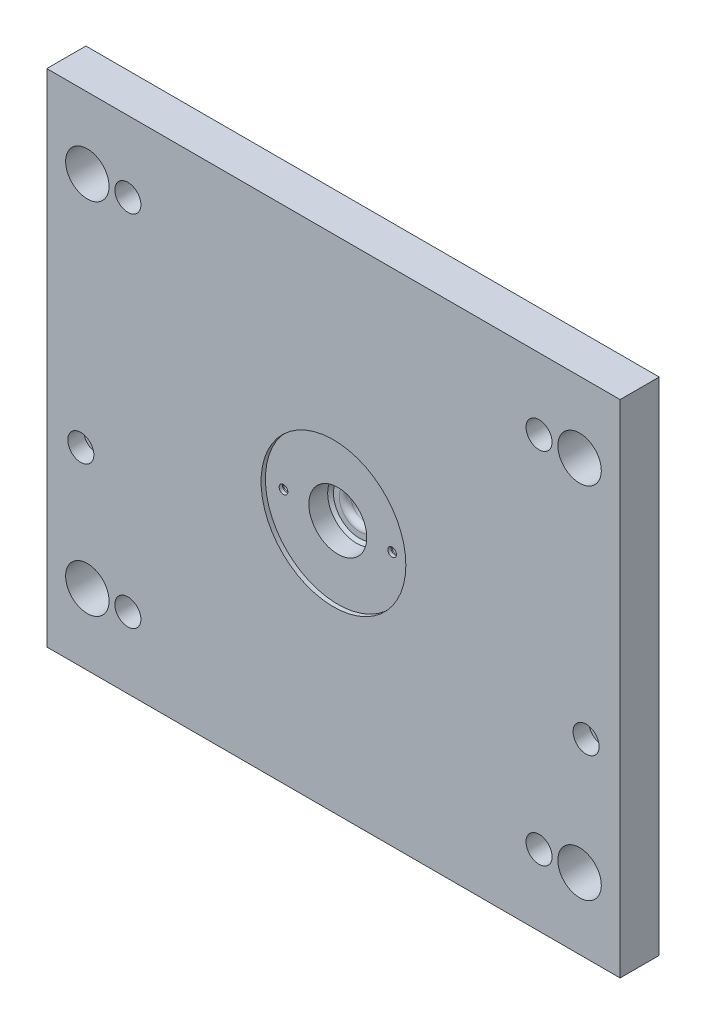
ISO-10303-21;
HEADER;
FILE_DESCRIPTION(('STEP AP214'),'2;1');
FILE_NAME('part.step','',(''),(''),'','','');
FILE_SCHEMA(('AUTOMOTIVE_DESIGN { 1 0 10303 214 1 1 1 1 }'));
ENDSEC;
DATA;
#1=APPLICATION_CONTEXT('core data for automotive mechanical design processes');
#2=APPLICATION_PROTOCOL_DEFINITION('international standard','automotive_design',2000,#1);
#3=PRODUCT_CONTEXT('',#1,'mechanical');
#4=PRODUCT('Part','Part','',(#3));
#5=PRODUCT_RELATED_PRODUCT_CATEGORY('part','',(#4));
#6=PRODUCT_DEFINITION_FORMATION('','',#4);
#7=PRODUCT_DEFINITION_CONTEXT('part definition',#1,'design');
#8=PRODUCT_DEFINITION('design','',#6,#7);
#9=PRODUCT_DEFINITION_SHAPE('','',#8);
#10=(LENGTH_UNIT() NAMED_UNIT(*) SI_UNIT(.MILLI.,.METRE.));
#11=(NAMED_UNIT(*) PLANE_ANGLE_UNIT() SI_UNIT($,.RADIAN.));
#12=(NAMED_UNIT(*) SI_UNIT($,.STERADIAN.) SOLID_ANGLE_UNIT());
#13=UNCERTAINTY_MEASURE_WITH_UNIT(LENGTH_MEASURE(1.E-05),#10,'distance_accuracy_value','');
#14=(GEOMETRIC_REPRESENTATION_CONTEXT(3) GLOBAL_UNCERTAINTY_ASSIGNED_CONTEXT((#13)) GLOBAL_UNIT_ASSIGNED_CONTEXT((#10,
#11,#12)) REPRESENTATION_CONTEXT('',''));
#15=CARTESIAN_POINT('',(0.,0.,0.));
#16=DIRECTION('',(0.,0.,1.));
#17=DIRECTION('',(1.,0.,0.));
#18=AXIS2_PLACEMENT_3D('',#15,#16,#17);
#19=CARTESIAN_POINT('',(0.,0.,60.));
#20=DIRECTION('',(0.,0.,-1.));
#21=DIRECTION('',(-1.,0.,0.));
#22=AXIS2_PLACEMENT_3D('',#19,#20,#21);
#23=PLANE('',#22);
#24=CARTESIAN_POINT('',(-37.5,1.71032187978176E-13,60.));
#25=DIRECTION('',(0.,0.,-1.));
#26=DIRECTION('',(-1.,0.,0.));
#27=AXIS2_PLACEMENT_3D('',#24,#25,#26);
#28=CIRCLE('',#27,3.);
#29=CARTESIAN_POINT('',(-40.5,1.71032187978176E-13,60.));
#30=VERTEX_POINT('',#29);
#31=EDGE_CURVE('E115',#30,#30,#28,.T.);
#32=ORIENTED_EDGE('',*,*,#31,.T.);
#33=EDGE_LOOP('',(#32));
#34=FACE_BOUND('',#33,.T.);
#35=CARTESIAN_POINT('',(37.5,1.7562446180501E-13,60.));
#36=DIRECTION('',(0.,0.,-1.));
#37=DIRECTION('',(-1.,0.,0.));
#38=AXIS2_PLACEMENT_3D('',#35,#36,#37);
#39=CIRCLE('',#38,3.);
#40=CARTESIAN_POINT('',(34.5,1.7562446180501E-13,60.));
#41=VERTEX_POINT('',#40);
#42=EDGE_CURVE('E186',#41,#41,#39,.T.);
#43=ORIENTED_EDGE('',*,*,#42,.T.);
#44=EDGE_LOOP('',(#43));
#45=FACE_BOUND('',#44,.T.);
#46=CARTESIAN_POINT('',(0.,0.,60.));
#47=DIRECTION('',(0.,0.,1.));
#48=DIRECTION('',(1.,0.,0.));
#49=AXIS2_PLACEMENT_3D('',#46,#47,#48);
#50=CIRCLE('',#49,50.);
#51=CARTESIAN_POINT('',(50.,0.,60.));
#52=VERTEX_POINT('',#51);
#53=EDGE_CURVE('E183',#52,#52,#50,.T.);
#54=ORIENTED_EDGE('',*,*,#53,.T.);
#55=EDGE_LOOP('',(#54));
#56=FACE_BOUND('',#55,.T.);
#57=CARTESIAN_POINT('',(0.,0.,60.));
#58=DIRECTION('',(0.,0.,-1.));
#59=DIRECTION('',(-1.,0.,0.));
#60=AXIS2_PLACEMENT_3D('',#57,#58,#59);
#61=CIRCLE('',#60,20.);
#62=CARTESIAN_POINT('',(-20.,0.,60.));
#63=VERTEX_POINT('',#62);
#64=EDGE_CURVE('E187',#63,#63,#61,.F.);
#65=ORIENTED_EDGE('',*,*,#64,.F.);
#66=EDGE_LOOP('',(#65));
#67=FACE_BOUND('',#66,.T.);
#68=ADVANCED_FACE('F16',(#34,#45,#56,#67),#23,.F.);
#69=CARTESIAN_POINT('',(198.,173.,63.));
#70=DIRECTION('',(1.,0.,0.));
#71=DIRECTION('',(0.,1.,0.));
#72=AXIS2_PLACEMENT_3D('',#69,#70,#71);
#73=PLANE('',#72);
#74=DIRECTION('',(0.,-1.,0.));
#75=VECTOR('',#74,1.);
#76=CARTESIAN_POINT('',(198.,173.,36.));
#77=LINE('',#76,#75);
#78=CARTESIAN_POINT('',(198.,173.,36.));
#79=VERTEX_POINT('',#78);
#80=CARTESIAN_POINT('',(198.,-173.,36.));
#81=VERTEX_POINT('',#80);
#82=EDGE_CURVE('E78',#79,#81,#77,.T.);
#83=ORIENTED_EDGE('',*,*,#82,.F.);
#84=DIRECTION('',(0.,0.,-1.));
#85=VECTOR('',#84,1.);
#86=CARTESIAN_POINT('',(198.,173.,63.));
#87=LINE('',#86,#85);
#88=CARTESIAN_POINT('',(198.,173.,63.));
#89=VERTEX_POINT('',#88);
#90=EDGE_CURVE('E74',#89,#79,#87,.T.);
#91=ORIENTED_EDGE('',*,*,#90,.F.);
#92=DIRECTION('',(0.,-1.,0.));
#93=VECTOR('',#92,1.);
#94=CARTESIAN_POINT('',(198.,173.,63.));
#95=LINE('',#94,#93);
#96=CARTESIAN_POINT('',(198.,-173.,63.));
#97=VERTEX_POINT('',#96);
#98=EDGE_CURVE('E112',#89,#97,#95,.T.);
#99=ORIENTED_EDGE('',*,*,#98,.T.);
#100=DIRECTION('',(0.,0.,-1.));
#101=VECTOR('',#100,1.);
#102=CARTESIAN_POINT('',(198.,-173.,63.));
#103=LINE('',#102,#101);
#104=EDGE_CURVE('E111',#97,#81,#103,.T.);
#105=ORIENTED_EDGE('',*,*,#104,.T.);
#106=EDGE_LOOP('',(#83,#91,#99,#105));
#107=FACE_BOUND('',#106,.T.);
#108=ADVANCED_FACE('F270',(#107),#73,.T.);
#109=CARTESIAN_POINT('',(198.,-173.,63.));
#110=DIRECTION('',(0.,-1.,0.));
#111=DIRECTION('',(1.,0.,0.));
#112=AXIS2_PLACEMENT_3D('',#109,#110,#111);
#113=PLANE('',#112);
#114=DIRECTION('',(-1.,0.,0.));
#115=VECTOR('',#114,1.);
#116=CARTESIAN_POINT('',(198.,-173.,36.));
#117=LINE('',#116,#115);
#118=CARTESIAN_POINT('',(-198.,-173.,36.));
#119=VERTEX_POINT('',#118);
#120=EDGE_CURVE('E84',#81,#119,#117,.T.);
#121=ORIENTED_EDGE('',*,*,#120,.F.);
#122=ORIENTED_EDGE('',*,*,#104,.F.);
#123=DIRECTION('',(-1.,0.,0.));
#124=VECTOR('',#123,1.);
#125=CARTESIAN_POINT('',(198.,-173.,63.));
#126=LINE('',#125,#124);
#127=CARTESIAN_POINT('',(-198.,-173.,63.));
#128=VERTEX_POINT('',#127);
#129=EDGE_CURVE('E108',#97,#128,#126,.T.);
#130=ORIENTED_EDGE('',*,*,#129,.T.);
#131=DIRECTION('',(0.,0.,-1.));
#132=VECTOR('',#131,1.);
#133=CARTESIAN_POINT('',(-198.,-173.,63.));
#134=LINE('',#133,#132);
#135=EDGE_CURVE('E107',#128,#119,#134,.T.);
#136=ORIENTED_EDGE('',*,*,#135,.T.);
#137=EDGE_LOOP('',(#121,#122,#130,#136));
#138=FACE_BOUND('',#137,.T.);
#139=ADVANCED_FACE('F275',(#138),#113,.T.);
#140=CARTESIAN_POINT('',(-198.,-173.,63.));
#141=DIRECTION('',(-1.,0.,0.));
#142=DIRECTION('',(0.,-1.,0.));
#143=AXIS2_PLACEMENT_3D('',#140,#141,#142);
#144=PLANE('',#143);
#145=DIRECTION('',(0.,1.,0.));
#146=VECTOR('',#145,1.);
#147=CARTESIAN_POINT('',(-198.,-173.,36.));
#148=LINE('',#147,#146);
#149=CARTESIAN_POINT('',(-198.,173.,36.));
#150=VERTEX_POINT('',#149);
#151=EDGE_CURVE('E63',#119,#150,#148,.T.);
#152=ORIENTED_EDGE('',*,*,#151,.F.);
#153=ORIENTED_EDGE('',*,*,#135,.F.);
#154=DIRECTION('',(0.,1.,0.));
#155=VECTOR('',#154,1.);
#156=CARTESIAN_POINT('',(-198.,-173.,63.));
#157=LINE('',#156,#155);
#158=CARTESIAN_POINT('',(-198.,173.,63.));
#159=VERTEX_POINT('',#158);
#160=EDGE_CURVE('E66',#128,#159,#157,.T.);
#161=ORIENTED_EDGE('',*,*,#160,.T.);
#162=DIRECTION('',(0.,0.,-1.));
#163=VECTOR('',#162,1.);
#164=CARTESIAN_POINT('',(-198.,173.,63.));
#165=LINE('',#164,#163);
#166=EDGE_CURVE('E59',#159,#150,#165,.T.);
#167=ORIENTED_EDGE('',*,*,#166,.T.);
#168=EDGE_LOOP('',(#152,#153,#161,#167));
#169=FACE_BOUND('',#168,.T.);
#170=ADVANCED_FACE('F61',(#169),#144,.T.);
#171=CARTESIAN_POINT('',(170.,-124.,63.));
#172=DIRECTION('',(0.,0.,-1.));
#173=DIRECTION('',(-1.,0.,0.));
#174=AXIS2_PLACEMENT_3D('',#171,#172,#173);
#175=CYLINDRICAL_SURFACE('',#174,15.);
#176=CARTESIAN_POINT('',(170.,-124.,63.));
#177=DIRECTION('',(0.,0.,1.));
#178=DIRECTION('',(0.,1.,0.));
#179=AXIS2_PLACEMENT_3D('',#176,#177,#178);
#180=CIRCLE('',#179,15.);
#181=CARTESIAN_POINT('',(170.,-109.,63.));
#182=VERTEX_POINT('',#181);
#183=EDGE_CURVE('E69',#182,#182,#180,.T.);
#184=ORIENTED_EDGE('',*,*,#183,.T.);
#185=EDGE_LOOP('',(#184));
#186=FACE_BOUND('',#185,.T.);
#187=CARTESIAN_POINT('',(170.,-124.,36.));
#188=DIRECTION('',(0.,0.,1.));
#189=DIRECTION('',(0.,1.,0.));
#190=AXIS2_PLACEMENT_3D('',#187,#188,#189);
#191=CIRCLE('',#190,15.);
#192=CARTESIAN_POINT('',(170.,-109.,36.));
#193=VERTEX_POINT('',#192);
#194=EDGE_CURVE('E246',#193,#193,#191,.T.);
#195=ORIENTED_EDGE('',*,*,#194,.F.);
#196=EDGE_LOOP('',(#195));
#197=FACE_BOUND('',#196,.T.);
#198=ADVANCED_FACE('F257',(#186,#197),#175,.F.);
#199=CARTESIAN_POINT('',(-170.,-124.,63.));
#200=DIRECTION('',(0.,0.,-1.));
#201=DIRECTION('',(-1.,0.,0.));
#202=AXIS2_PLACEMENT_3D('',#199,#200,#201);
#203=CYLINDRICAL_SURFACE('',#202,15.);
#204=CARTESIAN_POINT('',(-170.,-124.,63.));
#205=DIRECTION('',(0.,0.,1.));
#206=DIRECTION('',(0.,1.,0.));
#207=AXIS2_PLACEMENT_3D('',#204,#205,#206);
#208=CIRCLE('',#207,15.);
#209=CARTESIAN_POINT('',(-170.,-109.,63.));
#210=VERTEX_POINT('',#209);
#211=EDGE_CURVE('E99',#210,#210,#208,.T.);
#212=ORIENTED_EDGE('',*,*,#211,.T.);
#213=EDGE_LOOP('',(#212));
#214=FACE_BOUND('',#213,.T.);
#215=CARTESIAN_POINT('',(-170.,-124.,36.));
#216=DIRECTION('',(0.,0.,1.));
#217=DIRECTION('',(0.,1.,0.));
#218=AXIS2_PLACEMENT_3D('',#215,#216,#217);
#219=CIRCLE('',#218,15.);
#220=CARTESIAN_POINT('',(-170.,-109.,36.));
#221=VERTEX_POINT('',#220);
#222=EDGE_CURVE('E88',#221,#221,#219,.T.);
#223=ORIENTED_EDGE('',*,*,#222,.F.);
#224=EDGE_LOOP('',(#223));
#225=FACE_BOUND('',#224,.T.);
#226=ADVANCED_FACE('F254',(#214,#225),#203,.F.);
#227=CARTESIAN_POINT('',(-170.,124.,63.));
#228=DIRECTION('',(0.,0.,-1.));
#229=DIRECTION('',(-1.,0.,0.));
#230=AXIS2_PLACEMENT_3D('',#227,#228,#229);
#231=CYLINDRICAL_SURFACE('',#230,15.);
#232=CARTESIAN_POINT('',(-170.,124.,63.));
#233=DIRECTION('',(0.,0.,1.));
#234=DIRECTION('',(0.,1.,0.));
#235=AXIS2_PLACEMENT_3D('',#232,#233,#234);
#236=CIRCLE('',#235,15.);
#237=CARTESIAN_POINT('',(-170.,139.,63.));
#238=VERTEX_POINT('',#237);
#239=EDGE_CURVE('E102',#238,#238,#236,.T.);
#240=ORIENTED_EDGE('',*,*,#239,.T.);
#241=EDGE_LOOP('',(#240));
#242=FACE_BOUND('',#241,.T.);
#243=CARTESIAN_POINT('',(-170.,124.,36.));
#244=DIRECTION('',(0.,0.,1.));
#245=DIRECTION('',(0.,1.,0.));
#246=AXIS2_PLACEMENT_3D('',#243,#244,#245);
#247=CIRCLE('',#246,15.);
#248=CARTESIAN_POINT('',(-170.,139.,36.));
#249=VERTEX_POINT('',#248);
#250=EDGE_CURVE('E85',#249,#249,#247,.T.);
#251=ORIENTED_EDGE('',*,*,#250,.F.);
#252=EDGE_LOOP('',(#251));
#253=FACE_BOUND('',#252,.T.);
#254=ADVANCED_FACE('F256',(#242,#253),#231,.F.);
#255=CARTESIAN_POINT('',(-198.,173.,63.));
#256=DIRECTION('',(0.,1.,0.));
#257=DIRECTION('',(-1.,0.,0.));
#258=AXIS2_PLACEMENT_3D('',#255,#256,#257);
#259=PLANE('',#258);
#260=DIRECTION('',(1.,0.,0.));
#261=VECTOR('',#260,1.);
#262=CARTESIAN_POINT('',(-198.,173.,36.));
#263=LINE('',#262,#261);
#264=EDGE_CURVE('E72',#150,#79,#263,.T.);
#265=ORIENTED_EDGE('',*,*,#264,.F.);
#266=ORIENTED_EDGE('',*,*,#166,.F.);
#267=DIRECTION('',(1.,0.,0.));
#268=VECTOR('',#267,1.);
#269=CARTESIAN_POINT('',(0.,173.,63.));
#270=LINE('',#269,#268);
#271=EDGE_CURVE('E105',#159,#89,#270,.T.);
#272=ORIENTED_EDGE('',*,*,#271,.T.);
#273=ORIENTED_EDGE('',*,*,#90,.T.);
#274=EDGE_LOOP('',(#265,#266,#272,#273));
#275=FACE_BOUND('',#274,.T.);
#276=ADVANCED_FACE('F73',(#275),#259,.T.);
#277=CARTESIAN_POINT('',(170.,124.,63.));
#278=DIRECTION('',(0.,0.,-1.));
#279=DIRECTION('',(-1.,0.,0.));
#280=AXIS2_PLACEMENT_3D('',#277,#278,#279);
#281=CYLINDRICAL_SURFACE('',#280,15.);
#282=CARTESIAN_POINT('',(170.,124.,63.));
#283=DIRECTION('',(0.,0.,1.));
#284=DIRECTION('',(0.,1.,0.));
#285=AXIS2_PLACEMENT_3D('',#282,#283,#284);
#286=CIRCLE('',#285,15.);
#287=CARTESIAN_POINT('',(170.,139.,63.));
#288=VERTEX_POINT('',#287);
#289=EDGE_CURVE('E93',#288,#288,#286,.T.);
#290=ORIENTED_EDGE('',*,*,#289,.T.);
#291=EDGE_LOOP('',(#290));
#292=FACE_BOUND('',#291,.T.);
#293=CARTESIAN_POINT('',(170.,124.,36.));
#294=DIRECTION('',(0.,0.,1.));
#295=DIRECTION('',(0.,1.,0.));
#296=AXIS2_PLACEMENT_3D('',#293,#294,#295);
#297=CIRCLE('',#296,15.);
#298=CARTESIAN_POINT('',(170.,139.,36.));
#299=VERTEX_POINT('',#298);
#300=EDGE_CURVE('E121',#299,#299,#297,.T.);
#301=ORIENTED_EDGE('',*,*,#300,.F.);
#302=EDGE_LOOP('',(#301));
#303=FACE_BOUND('',#302,.T.);
#304=ADVANCED_FACE('F342',(#292,#303),#281,.F.);
#305=CARTESIAN_POINT('',(-170.,124.,63.));
#306=DIRECTION('',(0.,0.,1.));
#307=DIRECTION('',(1.,0.,0.));
#308=AXIS2_PLACEMENT_3D('',#305,#306,#307);
#309=PLANE('',#308);
#310=CARTESIAN_POINT('',(0.,0.,63.));
#311=DIRECTION('',(0.,0.,1.));
#312=DIRECTION('',(1.,0.,0.));
#313=AXIS2_PLACEMENT_3D('',#310,#311,#312);
#314=CIRCLE('',#313,50.);
#315=CARTESIAN_POINT('',(50.,0.,63.));
#316=VERTEX_POINT('',#315);
#317=EDGE_CURVE('E180',#316,#316,#314,.T.);
#318=ORIENTED_EDGE('',*,*,#317,.F.);
#319=EDGE_LOOP('',(#318));
#320=FACE_BOUND('',#319,.T.);
#321=CARTESIAN_POINT('',(-174.5,-41.85,63.));
#322=DIRECTION('',(0.,0.,-1.));
#323=DIRECTION('',(-1.,0.,0.));
#324=AXIS2_PLACEMENT_3D('',#321,#322,#323);
#325=CIRCLE('',#324,9.);
#326=CARTESIAN_POINT('',(-183.5,-41.85,63.));
#327=VERTEX_POINT('',#326);
#328=EDGE_CURVE('E96',#327,#327,#325,.T.);
#329=ORIENTED_EDGE('',*,*,#328,.T.);
#330=EDGE_LOOP('',(#329));
#331=FACE_BOUND('',#330,.T.);
#332=CARTESIAN_POINT('',(174.5,-41.85,63.));
#333=DIRECTION('',(0.,0.,-1.));
#334=DIRECTION('',(-1.,0.,0.));
#335=AXIS2_PLACEMENT_3D('',#332,#333,#334);
#336=CIRCLE('',#335,9.);
#337=CARTESIAN_POINT('',(165.5,-41.85,63.));
#338=VERTEX_POINT('',#337);
#339=EDGE_CURVE('E156',#338,#338,#336,.T.);
#340=ORIENTED_EDGE('',*,*,#339,.T.);
#341=EDGE_LOOP('',(#340));
#342=FACE_BOUND('',#341,.T.);
#343=CARTESIAN_POINT('',(-142.,-124.,63.));
#344=DIRECTION('',(0.,0.,-1.));
#345=DIRECTION('',(-1.,0.,0.));
#346=AXIS2_PLACEMENT_3D('',#343,#344,#345);
#347=CIRCLE('',#346,9.);
#348=CARTESIAN_POINT('',(-151.,-124.,63.));
#349=VERTEX_POINT('',#348);
#350=EDGE_CURVE('E147',#349,#349,#347,.T.);
#351=ORIENTED_EDGE('',*,*,#350,.T.);
#352=EDGE_LOOP('',(#351));
#353=FACE_BOUND('',#352,.T.);
#354=CARTESIAN_POINT('',(-142.,124.,63.));
#355=DIRECTION('',(0.,0.,-1.));
#356=DIRECTION('',(-1.,0.,0.));
#357=AXIS2_PLACEMENT_3D('',#354,#355,#356);
#358=CIRCLE('',#357,9.);
#359=CARTESIAN_POINT('',(-151.,124.,63.));
#360=VERTEX_POINT('',#359);
#361=EDGE_CURVE('E138',#360,#360,#358,.T.);
#362=ORIENTED_EDGE('',*,*,#361,.T.);
#363=EDGE_LOOP('',(#362));
#364=FACE_BOUND('',#363,.T.);
#365=CARTESIAN_POINT('',(142.,-124.,63.));
#366=DIRECTION('',(0.,0.,-1.));
#367=DIRECTION('',(-1.,0.,0.));
#368=AXIS2_PLACEMENT_3D('',#365,#366,#367);
#369=CIRCLE('',#368,9.);
#370=CARTESIAN_POINT('',(133.,-124.,63.));
#371=VERTEX_POINT('',#370);
#372=EDGE_CURVE('E129',#371,#371,#369,.T.);
#373=ORIENTED_EDGE('',*,*,#372,.T.);
#374=EDGE_LOOP('',(#373));
#375=FACE_BOUND('',#374,.T.);
#376=CARTESIAN_POINT('',(142.,124.,63.));
#377=DIRECTION('',(0.,0.,-1.));
#378=DIRECTION('',(-1.,0.,0.));
#379=AXIS2_PLACEMENT_3D('',#376,#377,#378);
#380=CIRCLE('',#379,9.);
#381=CARTESIAN_POINT('',(133.,124.,63.));
#382=VERTEX_POINT('',#381);
#383=EDGE_CURVE('E125',#382,#382,#380,.T.);
#384=ORIENTED_EDGE('',*,*,#383,.T.);
#385=EDGE_LOOP('',(#384));
#386=FACE_BOUND('',#385,.T.);
#387=ORIENTED_EDGE('',*,*,#271,.F.);
#388=ORIENTED_EDGE('',*,*,#160,.F.);
#389=ORIENTED_EDGE('',*,*,#129,.F.);
#390=ORIENTED_EDGE('',*,*,#98,.F.);
#391=EDGE_LOOP('',(#387,#388,#389,#390));
#392=FACE_BOUND('',#391,.T.);
#393=ORIENTED_EDGE('',*,*,#239,.F.);
#394=EDGE_LOOP('',(#393));
#395=FACE_BOUND('',#394,.T.);
#396=ORIENTED_EDGE('',*,*,#211,.F.);
#397=EDGE_LOOP('',(#396));
#398=FACE_BOUND('',#397,.T.);
#399=ORIENTED_EDGE('',*,*,#183,.F.);
#400=EDGE_LOOP('',(#399));
#401=FACE_BOUND('',#400,.T.);
#402=ORIENTED_EDGE('',*,*,#289,.F.);
#403=EDGE_LOOP('',(#402));
#404=FACE_BOUND('',#403,.T.);
#405=ADVANCED_FACE('F333',(#320,#331,#342,#353,#364,#375,#386,#392,#395,#398,#401,#404),#309,.T.);
#406=CARTESIAN_POINT('',(-170.,124.,36.));
#407=DIRECTION('',(0.,0.,1.));
#408=DIRECTION('',(1.,0.,0.));
#409=AXIS2_PLACEMENT_3D('',#406,#407,#408);
#410=PLANE('',#409);
#411=CARTESIAN_POINT('',(0.,0.,36.));
#412=DIRECTION('',(0.,0.,1.));
#413=DIRECTION('',(1.,0.,0.));
#414=AXIS2_PLACEMENT_3D('',#411,#412,#413);
#415=CIRCLE('',#414,10.);
#416=CARTESIAN_POINT('',(10.,0.,36.));
#417=VERTEX_POINT('',#416);
#418=EDGE_CURVE('E128',#417,#417,#415,.T.);
#419=ORIENTED_EDGE('',*,*,#418,.T.);
#420=EDGE_LOOP('',(#419));
#421=FACE_BOUND('',#420,.T.);
#422=CARTESIAN_POINT('',(-174.5,-41.85,36.));
#423=DIRECTION('',(0.,0.,1.));
#424=DIRECTION('',(1.,0.,0.));
#425=AXIS2_PLACEMENT_3D('',#422,#423,#424);
#426=CIRCLE('',#425,5.25);
#427=CARTESIAN_POINT('',(-169.25,-41.85,36.));
#428=VERTEX_POINT('',#427);
#429=EDGE_CURVE('E214',#428,#428,#426,.T.);
#430=ORIENTED_EDGE('',*,*,#429,.T.);
#431=EDGE_LOOP('',(#430));
#432=FACE_BOUND('',#431,.T.);
#433=CARTESIAN_POINT('',(174.5,-41.85,36.));
#434=DIRECTION('',(0.,0.,1.));
#435=DIRECTION('',(1.,0.,0.));
#436=AXIS2_PLACEMENT_3D('',#433,#434,#435);
#437=CIRCLE('',#436,5.25);
#438=CARTESIAN_POINT('',(179.75,-41.85,36.));
#439=VERTEX_POINT('',#438);
#440=EDGE_CURVE('E227',#439,#439,#437,.T.);
#441=ORIENTED_EDGE('',*,*,#440,.T.);
#442=EDGE_LOOP('',(#441));
#443=FACE_BOUND('',#442,.T.);
#444=CARTESIAN_POINT('',(-142.,-124.,36.));
#445=DIRECTION('',(0.,0.,1.));
#446=DIRECTION('',(1.,0.,0.));
#447=AXIS2_PLACEMENT_3D('',#444,#445,#446);
#448=CIRCLE('',#447,6.);
#449=CARTESIAN_POINT('',(-136.,-124.,36.));
#450=VERTEX_POINT('',#449);
#451=EDGE_CURVE('E230',#450,#450,#448,.T.);
#452=ORIENTED_EDGE('',*,*,#451,.T.);
#453=EDGE_LOOP('',(#452));
#454=FACE_BOUND('',#453,.T.);
#455=CARTESIAN_POINT('',(-142.,124.,36.));
#456=DIRECTION('',(0.,0.,1.));
#457=DIRECTION('',(1.,0.,0.));
#458=AXIS2_PLACEMENT_3D('',#455,#456,#457);
#459=CIRCLE('',#458,6.);
#460=CARTESIAN_POINT('',(-136.,124.,36.));
#461=VERTEX_POINT('',#460);
#462=EDGE_CURVE('E233',#461,#461,#459,.T.);
#463=ORIENTED_EDGE('',*,*,#462,.T.);
#464=EDGE_LOOP('',(#463));
#465=FACE_BOUND('',#464,.T.);
#466=CARTESIAN_POINT('',(142.,-124.,36.));
#467=DIRECTION('',(0.,0.,1.));
#468=DIRECTION('',(1.,0.,0.));
#469=AXIS2_PLACEMENT_3D('',#466,#467,#468);
#470=CIRCLE('',#469,6.);
#471=CARTESIAN_POINT('',(148.,-124.,36.));
#472=VERTEX_POINT('',#471);
#473=EDGE_CURVE('E236',#472,#472,#470,.T.);
#474=ORIENTED_EDGE('',*,*,#473,.T.);
#475=EDGE_LOOP('',(#474));
#476=FACE_BOUND('',#475,.T.);
#477=CARTESIAN_POINT('',(142.,124.,36.));
#478=DIRECTION('',(0.,0.,1.));
#479=DIRECTION('',(1.,0.,0.));
#480=AXIS2_PLACEMENT_3D('',#477,#478,#479);
#481=CIRCLE('',#480,6.);
#482=CARTESIAN_POINT('',(148.,124.,36.));
#483=VERTEX_POINT('',#482);
#484=EDGE_CURVE('E79',#483,#483,#481,.T.);
#485=ORIENTED_EDGE('',*,*,#484,.T.);
#486=EDGE_LOOP('',(#485));
#487=FACE_BOUND('',#486,.T.);
#488=ORIENTED_EDGE('',*,*,#264,.T.);
#489=ORIENTED_EDGE('',*,*,#82,.T.);
#490=ORIENTED_EDGE('',*,*,#120,.T.);
#491=ORIENTED_EDGE('',*,*,#151,.T.);
#492=EDGE_LOOP('',(#488,#489,#490,#491));
#493=FACE_BOUND('',#492,.T.);
#494=ORIENTED_EDGE('',*,*,#250,.T.);
#495=EDGE_LOOP('',(#494));
#496=FACE_BOUND('',#495,.T.);
#497=ORIENTED_EDGE('',*,*,#222,.T.);
#498=EDGE_LOOP('',(#497));
#499=FACE_BOUND('',#498,.T.);
#500=ORIENTED_EDGE('',*,*,#194,.T.);
#501=EDGE_LOOP('',(#500));
#502=FACE_BOUND('',#501,.T.);
#503=ORIENTED_EDGE('',*,*,#300,.T.);
#504=EDGE_LOOP('',(#503));
#505=FACE_BOUND('',#504,.T.);
#506=ADVANCED_FACE('F81',(#421,#432,#443,#454,#465,#476,#487,#493,#496,#499,#502,#505),#410,.F.);
#507=CARTESIAN_POINT('',(142.,124.,-170.344155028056));
#508=DIRECTION('',(0.,0.,-1.));
#509=DIRECTION('',(-1.,0.,0.));
#510=AXIS2_PLACEMENT_3D('',#507,#508,#509);
#511=CYLINDRICAL_SURFACE('',#510,6.);
#512=CARTESIAN_POINT('',(142.,124.,47.5));
#513=DIRECTION('',(0.,0.,-1.));
#514=DIRECTION('',(-1.,0.,0.));
#515=AXIS2_PLACEMENT_3D('',#512,#513,#514);
#516=CIRCLE('',#515,6.);
#517=CARTESIAN_POINT('',(136.,124.,47.5));
#518=VERTEX_POINT('',#517);
#519=EDGE_CURVE('E117',#518,#518,#516,.T.);
#520=ORIENTED_EDGE('',*,*,#519,.F.);
#521=EDGE_LOOP('',(#520));
#522=FACE_BOUND('',#521,.T.);
#523=ORIENTED_EDGE('',*,*,#484,.F.);
#524=EDGE_LOOP('',(#523));
#525=FACE_BOUND('',#524,.T.);
#526=ADVANCED_FACE('F332',(#522,#525),#511,.F.);
#527=CARTESIAN_POINT('',(142.,124.,47.5));
#528=DIRECTION('',(0.,0.,-1.));
#529=DIRECTION('',(-1.,0.,0.));
#530=AXIS2_PLACEMENT_3D('',#527,#528,#529);
#531=PLANE('',#530);
#532=ORIENTED_EDGE('',*,*,#519,.T.);
#533=EDGE_LOOP('',(#532));
#534=FACE_BOUND('',#533,.T.);
#535=CARTESIAN_POINT('',(142.,124.,47.5));
#536=DIRECTION('',(0.,0.,-1.));
#537=DIRECTION('',(-1.,0.,0.));
#538=AXIS2_PLACEMENT_3D('',#535,#536,#537);
#539=CIRCLE('',#538,9.);
#540=CARTESIAN_POINT('',(133.,124.,47.5));
#541=VERTEX_POINT('',#540);
#542=EDGE_CURVE('E120',#541,#541,#539,.T.);
#543=ORIENTED_EDGE('',*,*,#542,.F.);
#544=EDGE_LOOP('',(#543));
#545=FACE_BOUND('',#544,.T.);
#546=ADVANCED_FACE('F339',(#534,#545),#531,.F.);
#547=CARTESIAN_POINT('',(142.,124.,63.));
#548=DIRECTION('',(0.,0.,-1.));
#549=DIRECTION('',(-1.,0.,0.));
#550=AXIS2_PLACEMENT_3D('',#547,#548,#549);
#551=CYLINDRICAL_SURFACE('',#550,9.);
#552=ORIENTED_EDGE('',*,*,#542,.T.);
#553=EDGE_LOOP('',(#552));
#554=FACE_BOUND('',#553,.T.);
#555=ORIENTED_EDGE('',*,*,#383,.F.);
#556=EDGE_LOOP('',(#555));
#557=FACE_BOUND('',#556,.T.);
#558=ADVANCED_FACE('F363',(#554,#557),#551,.F.);
#559=CARTESIAN_POINT('',(142.,-124.,-170.344155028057));
#560=DIRECTION('',(0.,0.,-1.));
#561=DIRECTION('',(-1.,0.,0.));
#562=AXIS2_PLACEMENT_3D('',#559,#560,#561);
#563=CYLINDRICAL_SURFACE('',#562,6.);
#564=CARTESIAN_POINT('',(142.,-124.,47.5));
#565=DIRECTION('',(0.,0.,-1.));
#566=DIRECTION('',(-1.,0.,0.));
#567=AXIS2_PLACEMENT_3D('',#564,#565,#566);
#568=CIRCLE('',#567,6.);
#569=CARTESIAN_POINT('',(136.,-124.,47.5));
#570=VERTEX_POINT('',#569);
#571=EDGE_CURVE('E124',#570,#570,#568,.T.);
#572=ORIENTED_EDGE('',*,*,#571,.F.);
#573=EDGE_LOOP('',(#572));
#574=FACE_BOUND('',#573,.T.);
#575=ORIENTED_EDGE('',*,*,#473,.F.);
#576=EDGE_LOOP('',(#575));
#577=FACE_BOUND('',#576,.T.);
#578=ADVANCED_FACE('F360',(#574,#577),#563,.F.);
#579=CARTESIAN_POINT('',(142.,-124.,47.5));
#580=DIRECTION('',(0.,0.,-1.));
#581=DIRECTION('',(-1.,0.,0.));
#582=AXIS2_PLACEMENT_3D('',#579,#580,#581);
#583=PLANE('',#582);
#584=ORIENTED_EDGE('',*,*,#571,.T.);
#585=EDGE_LOOP('',(#584));
#586=FACE_BOUND('',#585,.T.);
#587=CARTESIAN_POINT('',(142.,-124.,47.5));
#588=DIRECTION('',(0.,0.,-1.));
#589=DIRECTION('',(-1.,0.,0.));
#590=AXIS2_PLACEMENT_3D('',#587,#588,#589);
#591=CIRCLE('',#590,9.);
#592=CARTESIAN_POINT('',(133.,-124.,47.5));
#593=VERTEX_POINT('',#592);
#594=EDGE_CURVE('E132',#593,#593,#591,.T.);
#595=ORIENTED_EDGE('',*,*,#594,.F.);
#596=EDGE_LOOP('',(#595));
#597=FACE_BOUND('',#596,.T.);
#598=ADVANCED_FACE('F362',(#586,#597),#583,.F.);
#599=CARTESIAN_POINT('',(142.,-124.,63.));
#600=DIRECTION('',(0.,0.,-1.));
#601=DIRECTION('',(-1.,0.,0.));
#602=AXIS2_PLACEMENT_3D('',#599,#600,#601);
#603=CYLINDRICAL_SURFACE('',#602,9.);
#604=ORIENTED_EDGE('',*,*,#594,.T.);
#605=EDGE_LOOP('',(#604));
#606=FACE_BOUND('',#605,.T.);
#607=ORIENTED_EDGE('',*,*,#372,.F.);
#608=EDGE_LOOP('',(#607));
#609=FACE_BOUND('',#608,.T.);
#610=ADVANCED_FACE('F370',(#606,#609),#603,.F.);
#611=CARTESIAN_POINT('',(-142.,124.,-170.344155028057));
#612=DIRECTION('',(0.,0.,-1.));
#613=DIRECTION('',(-1.,0.,0.));
#614=AXIS2_PLACEMENT_3D('',#611,#612,#613);
#615=CYLINDRICAL_SURFACE('',#614,6.);
#616=CARTESIAN_POINT('',(-142.,124.,47.5));
#617=DIRECTION('',(0.,0.,-1.));
#618=DIRECTION('',(-1.,0.,0.));
#619=AXIS2_PLACEMENT_3D('',#616,#617,#618);
#620=CIRCLE('',#619,6.);
#621=CARTESIAN_POINT('',(-148.,124.,47.5));
#622=VERTEX_POINT('',#621);
#623=EDGE_CURVE('E135',#622,#622,#620,.T.);
#624=ORIENTED_EDGE('',*,*,#623,.F.);
#625=EDGE_LOOP('',(#624));
#626=FACE_BOUND('',#625,.T.);
#627=ORIENTED_EDGE('',*,*,#462,.F.);
#628=EDGE_LOOP('',(#627));
#629=FACE_BOUND('',#628,.T.);
#630=ADVANCED_FACE('F386',(#626,#629),#615,.F.);
#631=CARTESIAN_POINT('',(-142.,124.,47.5));
#632=DIRECTION('',(0.,0.,-1.));
#633=DIRECTION('',(-1.,0.,0.));
#634=AXIS2_PLACEMENT_3D('',#631,#632,#633);
#635=PLANE('',#634);
#636=ORIENTED_EDGE('',*,*,#623,.T.);
#637=EDGE_LOOP('',(#636));
#638=FACE_BOUND('',#637,.T.);
#639=CARTESIAN_POINT('',(-142.,124.,47.5));
#640=DIRECTION('',(0.,0.,-1.));
#641=DIRECTION('',(-1.,0.,0.));
#642=AXIS2_PLACEMENT_3D('',#639,#640,#641);
#643=CIRCLE('',#642,9.);
#644=CARTESIAN_POINT('',(-151.,124.,47.5));
#645=VERTEX_POINT('',#644);
#646=EDGE_CURVE('E141',#645,#645,#643,.T.);
#647=ORIENTED_EDGE('',*,*,#646,.F.);
#648=EDGE_LOOP('',(#647));
#649=FACE_BOUND('',#648,.T.);
#650=ADVANCED_FACE('F382',(#638,#649),#635,.F.);
#651=CARTESIAN_POINT('',(-142.,124.,63.));
#652=DIRECTION('',(0.,0.,-1.));
#653=DIRECTION('',(-1.,0.,0.));
#654=AXIS2_PLACEMENT_3D('',#651,#652,#653);
#655=CYLINDRICAL_SURFACE('',#654,9.);
#656=ORIENTED_EDGE('',*,*,#646,.T.);
#657=EDGE_LOOP('',(#656));
#658=FACE_BOUND('',#657,.T.);
#659=ORIENTED_EDGE('',*,*,#361,.F.);
#660=EDGE_LOOP('',(#659));
#661=FACE_BOUND('',#660,.T.);
#662=ADVANCED_FACE('F378',(#658,#661),#655,.F.);
#663=CARTESIAN_POINT('',(-142.,-124.,-170.344155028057));
#664=DIRECTION('',(0.,0.,-1.));
#665=DIRECTION('',(-1.,0.,0.));
#666=AXIS2_PLACEMENT_3D('',#663,#664,#665);
#667=CYLINDRICAL_SURFACE('',#666,6.);
#668=CARTESIAN_POINT('',(-142.,-124.,47.5));
#669=DIRECTION('',(0.,0.,-1.));
#670=DIRECTION('',(-1.,0.,0.));
#671=AXIS2_PLACEMENT_3D('',#668,#669,#670);
#672=CIRCLE('',#671,6.);
#673=CARTESIAN_POINT('',(-148.,-124.,47.5));
#674=VERTEX_POINT('',#673);
#675=EDGE_CURVE('E144',#674,#674,#672,.T.);
#676=ORIENTED_EDGE('',*,*,#675,.F.);
#677=EDGE_LOOP('',(#676));
#678=FACE_BOUND('',#677,.T.);
#679=ORIENTED_EDGE('',*,*,#451,.F.);
#680=EDGE_LOOP('',(#679));
#681=FACE_BOUND('',#680,.T.);
#682=ADVANCED_FACE('F381',(#678,#681),#667,.F.);
#683=CARTESIAN_POINT('',(-142.,-124.,47.5));
#684=DIRECTION('',(0.,0.,-1.));
#685=DIRECTION('',(-1.,0.,0.));
#686=AXIS2_PLACEMENT_3D('',#683,#684,#685);
#687=PLANE('',#686);
#688=ORIENTED_EDGE('',*,*,#675,.T.);
#689=EDGE_LOOP('',(#688));
#690=FACE_BOUND('',#689,.T.);
#691=CARTESIAN_POINT('',(-142.,-124.,47.5));
#692=DIRECTION('',(0.,0.,-1.));
#693=DIRECTION('',(-1.,0.,0.));
#694=AXIS2_PLACEMENT_3D('',#691,#692,#693);
#695=CIRCLE('',#694,9.);
#696=CARTESIAN_POINT('',(-151.,-124.,47.5));
#697=VERTEX_POINT('',#696);
#698=EDGE_CURVE('E150',#697,#697,#695,.T.);
#699=ORIENTED_EDGE('',*,*,#698,.F.);
#700=EDGE_LOOP('',(#699));
#701=FACE_BOUND('',#700,.T.);
#702=ADVANCED_FACE('F395',(#690,#701),#687,.F.);
#703=CARTESIAN_POINT('',(-142.,-124.,63.));
#704=DIRECTION('',(0.,0.,-1.));
#705=DIRECTION('',(-1.,0.,0.));
#706=AXIS2_PLACEMENT_3D('',#703,#704,#705);
#707=CYLINDRICAL_SURFACE('',#706,9.);
#708=ORIENTED_EDGE('',*,*,#698,.T.);
#709=EDGE_LOOP('',(#708));
#710=FACE_BOUND('',#709,.T.);
#711=ORIENTED_EDGE('',*,*,#350,.F.);
#712=EDGE_LOOP('',(#711));
#713=FACE_BOUND('',#712,.T.);
#714=ADVANCED_FACE('F391',(#710,#713),#707,.F.);
#715=CARTESIAN_POINT('',(174.5,-41.85,-177.809876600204));
#716=DIRECTION('',(0.,0.,-1.));
#717=DIRECTION('',(-1.,0.,0.));
#718=AXIS2_PLACEMENT_3D('',#715,#716,#717);
#719=CYLINDRICAL_SURFACE('',#718,5.25);
#720=CARTESIAN_POINT('',(174.5,-41.85,52.));
#721=DIRECTION('',(0.,0.,-1.));
#722=DIRECTION('',(-1.,0.,0.));
#723=AXIS2_PLACEMENT_3D('',#720,#721,#722);
#724=CIRCLE('',#723,5.25);
#725=CARTESIAN_POINT('',(169.25,-41.85,52.));
#726=VERTEX_POINT('',#725);
#727=EDGE_CURVE('E153',#726,#726,#724,.T.);
#728=ORIENTED_EDGE('',*,*,#727,.F.);
#729=EDGE_LOOP('',(#728));
#730=FACE_BOUND('',#729,.T.);
#731=ORIENTED_EDGE('',*,*,#440,.F.);
#732=EDGE_LOOP('',(#731));
#733=FACE_BOUND('',#732,.T.);
#734=ADVANCED_FACE('F394',(#730,#733),#719,.F.);
#735=CARTESIAN_POINT('',(174.5,-41.85,52.));
#736=DIRECTION('',(0.,0.,-1.));
#737=DIRECTION('',(-1.,0.,0.));
#738=AXIS2_PLACEMENT_3D('',#735,#736,#737);
#739=PLANE('',#738);
#740=ORIENTED_EDGE('',*,*,#727,.T.);
#741=EDGE_LOOP('',(#740));
#742=FACE_BOUND('',#741,.T.);
#743=CARTESIAN_POINT('',(174.5,-41.85,52.));
#744=DIRECTION('',(0.,0.,-1.));
#745=DIRECTION('',(-1.,0.,0.));
#746=AXIS2_PLACEMENT_3D('',#743,#744,#745);
#747=CIRCLE('',#746,9.);
#748=CARTESIAN_POINT('',(165.5,-41.85,52.));
#749=VERTEX_POINT('',#748);
#750=EDGE_CURVE('E169',#749,#749,#747,.T.);
#751=ORIENTED_EDGE('',*,*,#750,.F.);
#752=EDGE_LOOP('',(#751));
#753=FACE_BOUND('',#752,.T.);
#754=ADVANCED_FACE('F418',(#742,#753),#739,.F.);
#755=CARTESIAN_POINT('',(174.5,-41.85,63.));
#756=DIRECTION('',(0.,0.,-1.));
#757=DIRECTION('',(-1.,0.,0.));
#758=AXIS2_PLACEMENT_3D('',#755,#756,#757);
#759=CYLINDRICAL_SURFACE('',#758,9.);
#760=ORIENTED_EDGE('',*,*,#750,.T.);
#761=EDGE_LOOP('',(#760));
#762=FACE_BOUND('',#761,.T.);
#763=ORIENTED_EDGE('',*,*,#339,.F.);
#764=EDGE_LOOP('',(#763));
#765=FACE_BOUND('',#764,.T.);
#766=ADVANCED_FACE('F415',(#762,#765),#759,.F.);
#767=CARTESIAN_POINT('',(-174.5,-41.85,-177.809876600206));
#768=DIRECTION('',(0.,0.,-1.));
#769=DIRECTION('',(-1.,0.,0.));
#770=AXIS2_PLACEMENT_3D('',#767,#768,#769);
#771=CYLINDRICAL_SURFACE('',#770,5.25);
#772=CARTESIAN_POINT('',(-174.5,-41.85,52.));
#773=DIRECTION('',(0.,0.,-1.));
#774=DIRECTION('',(-1.,0.,0.));
#775=AXIS2_PLACEMENT_3D('',#772,#773,#774);
#776=CIRCLE('',#775,5.25);
#777=CARTESIAN_POINT('',(-179.75,-41.85,52.));
#778=VERTEX_POINT('',#777);
#779=EDGE_CURVE('E172',#778,#778,#776,.T.);
#780=ORIENTED_EDGE('',*,*,#779,.F.);
#781=EDGE_LOOP('',(#780));
#782=FACE_BOUND('',#781,.T.);
#783=ORIENTED_EDGE('',*,*,#429,.F.);
#784=EDGE_LOOP('',(#783));
#785=FACE_BOUND('',#784,.T.);
#786=ADVANCED_FACE('F302',(#782,#785),#771,.F.);
#787=CARTESIAN_POINT('',(-174.5,-41.85,52.));
#788=DIRECTION('',(0.,0.,-1.));
#789=DIRECTION('',(-1.,0.,0.));
#790=AXIS2_PLACEMENT_3D('',#787,#788,#789);
#791=PLANE('',#790);
#792=ORIENTED_EDGE('',*,*,#779,.T.);
#793=EDGE_LOOP('',(#792));
#794=FACE_BOUND('',#793,.T.);
#795=CARTESIAN_POINT('',(-174.5,-41.85,52.));
#796=DIRECTION('',(0.,0.,-1.));
#797=DIRECTION('',(-1.,0.,0.));
#798=AXIS2_PLACEMENT_3D('',#795,#796,#797);
#799=CIRCLE('',#798,9.);
#800=CARTESIAN_POINT('',(-183.5,-41.85,52.));
#801=VERTEX_POINT('',#800);
#802=EDGE_CURVE('E177',#801,#801,#799,.T.);
#803=ORIENTED_EDGE('',*,*,#802,.F.);
#804=EDGE_LOOP('',(#803));
#805=FACE_BOUND('',#804,.T.);
#806=ADVANCED_FACE('F297',(#794,#805),#791,.F.);
#807=CARTESIAN_POINT('',(-174.5,-41.85,63.));
#808=DIRECTION('',(0.,0.,-1.));
#809=DIRECTION('',(-1.,0.,0.));
#810=AXIS2_PLACEMENT_3D('',#807,#808,#809);
#811=CYLINDRICAL_SURFACE('',#810,9.);
#812=ORIENTED_EDGE('',*,*,#802,.T.);
#813=EDGE_LOOP('',(#812));
#814=FACE_BOUND('',#813,.T.);
#815=ORIENTED_EDGE('',*,*,#328,.F.);
#816=EDGE_LOOP('',(#815));
#817=FACE_BOUND('',#816,.T.);
#818=ADVANCED_FACE('F287',(#814,#817),#811,.F.);
#819=CARTESIAN_POINT('',(0.,0.,60.));
#820=DIRECTION('',(0.,0.,1.));
#821=DIRECTION('',(1.,0.,0.));
#822=AXIS2_PLACEMENT_3D('',#819,#820,#821);
#823=CYLINDRICAL_SURFACE('',#822,50.);
#824=ORIENTED_EDGE('',*,*,#317,.T.);
#825=EDGE_LOOP('',(#824));
#826=FACE_BOUND('',#825,.T.);
#827=ORIENTED_EDGE('',*,*,#53,.F.);
#828=EDGE_LOOP('',(#827));
#829=FACE_BOUND('',#828,.T.);
#830=ADVANCED_FACE('F284',(#826,#829),#823,.F.);
#831=CARTESIAN_POINT('',(37.5,1.7562446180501E-13,57.));
#832=DIRECTION('',(0.,0.,1.));
#833=DIRECTION('',(1.,0.,0.));
#834=AXIS2_PLACEMENT_3D('',#831,#832,#833);
#835=CYLINDRICAL_SURFACE('',#834,3.);
#836=CARTESIAN_POINT('',(37.5,1.7562446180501E-13,57.75));
#837=DIRECTION('',(0.,0.,-1.));
#838=DIRECTION('',(-1.,0.,0.));
#839=AXIS2_PLACEMENT_3D('',#836,#837,#838);
#840=CIRCLE('',#839,3.);
#841=CARTESIAN_POINT('',(34.5,1.7562446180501E-13,57.75));
#842=VERTEX_POINT('',#841);
#843=EDGE_CURVE('E188',#842,#842,#840,.F.);
#844=ORIENTED_EDGE('',*,*,#843,.F.);
#845=EDGE_LOOP('',(#844));
#846=FACE_BOUND('',#845,.T.);
#847=ORIENTED_EDGE('',*,*,#42,.F.);
#848=EDGE_LOOP('',(#847));
#849=FACE_BOUND('',#848,.T.);
#850=ADVANCED_FACE('F286',(#846,#849),#835,.F.);
#851=CARTESIAN_POINT('',(37.5,1.7562446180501E-13,57.75));
#852=DIRECTION('',(0.,0.,1.));
#853=DIRECTION('',(1.,0.,0.));
#854=AXIS2_PLACEMENT_3D('',#851,#852,#853);
#855=CONICAL_SURFACE('',#854,3.,0.785398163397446);
#856=ORIENTED_EDGE('',*,*,#843,.T.);
#857=EDGE_LOOP('',(#856));
#858=FACE_BOUND('',#857,.T.);
#859=CARTESIAN_POINT('',(37.5,1.7562446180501E-13,57.35));
#860=DIRECTION('',(0.,0.,1.));
#861=DIRECTION('',(1.,0.,0.));
#862=AXIS2_PLACEMENT_3D('',#859,#860,#861);
#863=CIRCLE('',#862,2.6);
#864=CARTESIAN_POINT('',(40.1,1.7562446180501E-13,57.35));
#865=VERTEX_POINT('',#864);
#866=EDGE_CURVE('E161',#865,#865,#863,.T.);
#867=ORIENTED_EDGE('',*,*,#866,.F.);
#868=EDGE_LOOP('',(#867));
#869=FACE_BOUND('',#868,.T.);
#870=ADVANCED_FACE('F294',(#858,#869),#855,.F.);
#871=CARTESIAN_POINT('',(37.5,0.,51.));
#872=DIRECTION('',(0.,0.,1.));
#873=DIRECTION('',(1.,0.,0.));
#874=AXIS2_PLACEMENT_3D('',#871,#872,#873);
#875=CONICAL_SURFACE('',#874,2.6,1.02974425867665);
#876=CARTESIAN_POINT('',(37.5,0.,51.));
#877=DIRECTION('',(0.,0.,-1.));
#878=DIRECTION('',(-1.,0.,0.));
#879=AXIS2_PLACEMENT_3D('',#876,#877,#878);
#880=CIRCLE('',#879,2.6);
#881=CARTESIAN_POINT('',(34.9,0.,51.));
#882=VERTEX_POINT('',#881);
#883=EDGE_CURVE('E157',#882,#882,#880,.T.);
#884=ORIENTED_EDGE('',*,*,#883,.F.);
#885=EDGE_LOOP('',(#884));
#886=FACE_BOUND('',#885,.T.);
#887=CARTESIAN_POINT('',(37.5,0.,49.4377623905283));
#888=VERTEX_POINT('',#887);
#889=VERTEX_LOOP('',#888);
#890=FACE_BOUND('',#889,.T.);
#891=ADVANCED_FACE('F305',(#886,#890),#875,.F.);
#892=CARTESIAN_POINT('',(37.5,0.,63.));
#893=DIRECTION('',(0.,0.,-1.));
#894=DIRECTION('',(-1.,0.,0.));
#895=AXIS2_PLACEMENT_3D('',#892,#893,#894);
#896=CYLINDRICAL_SURFACE('',#895,2.6);
#897=ORIENTED_EDGE('',*,*,#866,.T.);
#898=EDGE_LOOP('',(#897));
#899=FACE_BOUND('',#898,.T.);
#900=ORIENTED_EDGE('',*,*,#883,.T.);
#901=EDGE_LOOP('',(#900));
#902=FACE_BOUND('',#901,.T.);
#903=ADVANCED_FACE('F316',(#899,#902),#896,.F.);
#904=CARTESIAN_POINT('',(-37.5,1.71032187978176E-13,57.));
#905=DIRECTION('',(0.,0.,1.));
#906=DIRECTION('',(1.,0.,0.));
#907=AXIS2_PLACEMENT_3D('',#904,#905,#906);
#908=CYLINDRICAL_SURFACE('',#907,3.);
#909=CARTESIAN_POINT('',(-37.5,1.71032187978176E-13,57.75));
#910=DIRECTION('',(0.,0.,-1.));
#911=DIRECTION('',(-1.,0.,0.));
#912=AXIS2_PLACEMENT_3D('',#909,#910,#911);
#913=CIRCLE('',#912,3.);
#914=CARTESIAN_POINT('',(-40.5,1.71032187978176E-13,57.75));
#915=VERTEX_POINT('',#914);
#916=EDGE_CURVE('E160',#915,#915,#913,.F.);
#917=ORIENTED_EDGE('',*,*,#916,.F.);
#918=EDGE_LOOP('',(#917));
#919=FACE_BOUND('',#918,.T.);
#920=ORIENTED_EDGE('',*,*,#31,.F.);
#921=EDGE_LOOP('',(#920));
#922=FACE_BOUND('',#921,.T.);
#923=ADVANCED_FACE('F312',(#919,#922),#908,.F.);
#924=CARTESIAN_POINT('',(-37.5,1.71032187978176E-13,57.75));
#925=DIRECTION('',(0.,0.,1.));
#926=DIRECTION('',(1.,0.,0.));
#927=AXIS2_PLACEMENT_3D('',#924,#925,#926);
#928=CONICAL_SURFACE('',#927,3.,0.785398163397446);
#929=ORIENTED_EDGE('',*,*,#916,.T.);
#930=EDGE_LOOP('',(#929));
#931=FACE_BOUND('',#930,.T.);
#932=CARTESIAN_POINT('',(-37.5,1.71032187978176E-13,57.35));
#933=DIRECTION('',(0.,0.,1.));
#934=DIRECTION('',(1.,0.,0.));
#935=AXIS2_PLACEMENT_3D('',#932,#933,#934);
#936=CIRCLE('',#935,2.6);
#937=CARTESIAN_POINT('',(-34.9,1.71032187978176E-13,57.35));
#938=VERTEX_POINT('',#937);
#939=EDGE_CURVE('E166',#938,#938,#936,.T.);
#940=ORIENTED_EDGE('',*,*,#939,.F.);
#941=EDGE_LOOP('',(#940));
#942=FACE_BOUND('',#941,.T.);
#943=ADVANCED_FACE('F308',(#931,#942),#928,.F.);
#944=CARTESIAN_POINT('',(-37.5,0.,51.));
#945=DIRECTION('',(0.,0.,1.));
#946=DIRECTION('',(1.,0.,0.));
#947=AXIS2_PLACEMENT_3D('',#944,#945,#946);
#948=CONICAL_SURFACE('',#947,2.6,1.02974425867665);
#949=CARTESIAN_POINT('',(-37.5,0.,51.));
#950=DIRECTION('',(0.,0.,-1.));
#951=DIRECTION('',(-1.,0.,0.));
#952=AXIS2_PLACEMENT_3D('',#949,#950,#951);
#953=CIRCLE('',#952,2.6);
#954=CARTESIAN_POINT('',(-40.1,0.,51.));
#955=VERTEX_POINT('',#954);
#956=EDGE_CURVE('E162',#955,#955,#953,.T.);
#957=ORIENTED_EDGE('',*,*,#956,.F.);
#958=EDGE_LOOP('',(#957));
#959=FACE_BOUND('',#958,.T.);
#960=CARTESIAN_POINT('',(-37.5,0.,49.4377623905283));
#961=VERTEX_POINT('',#960);
#962=VERTEX_LOOP('',#961);
#963=FACE_BOUND('',#962,.T.);
#964=ADVANCED_FACE('F311',(#959,#963),#948,.F.);
#965=CARTESIAN_POINT('',(-37.5,0.,63.));
#966=DIRECTION('',(0.,0.,-1.));
#967=DIRECTION('',(-1.,0.,0.));
#968=AXIS2_PLACEMENT_3D('',#965,#966,#967);
#969=CYLINDRICAL_SURFACE('',#968,2.6);
#970=ORIENTED_EDGE('',*,*,#939,.T.);
#971=EDGE_LOOP('',(#970));
#972=FACE_BOUND('',#971,.T.);
#973=ORIENTED_EDGE('',*,*,#956,.T.);
#974=EDGE_LOOP('',(#973));
#975=FACE_BOUND('',#974,.T.);
#976=ADVANCED_FACE('F324',(#972,#975),#969,.F.);
#977=CARTESIAN_POINT('',(0.,0.,5.));
#978=DIRECTION('',(0.,0.,1.));
#979=DIRECTION('',(1.,0.,0.));
#980=AXIS2_PLACEMENT_3D('',#977,#978,#979);
#981=CYLINDRICAL_SURFACE('',#980,10.);
#982=CARTESIAN_POINT('',(0.,0.,41.));
#983=DIRECTION('',(0.,0.,-1.));
#984=DIRECTION('',(-1.,0.,0.));
#985=AXIS2_PLACEMENT_3D('',#982,#983,#984);
#986=CIRCLE('',#985,10.);
#987=CARTESIAN_POINT('',(-10.,0.,41.));
#988=VERTEX_POINT('',#987);
#989=EDGE_CURVE('E11',#988,#988,#986,.T.);
#990=ORIENTED_EDGE('',*,*,#989,.F.);
#991=EDGE_LOOP('',(#990));
#992=FACE_BOUND('',#991,.T.);
#993=ORIENTED_EDGE('',*,*,#418,.F.);
#994=EDGE_LOOP('',(#993));
#995=FACE_BOUND('',#994,.T.);
#996=ADVANCED_FACE('F322',(#992,#995),#981,.F.);
#997=CARTESIAN_POINT('',(0.,0.,45.));
#998=DIRECTION('',(0.,0.,-1.));
#999=DIRECTION('',(-1.,0.,0.));
#1000=AXIS2_PLACEMENT_3D('',#997,#998,#999);
#1001=PLANE('',#1000);
#1002=CARTESIAN_POINT('',(0.,0.,45.));
#1003=DIRECTION('',(0.,0.,-1.));
#1004=DIRECTION('',(-1.,0.,0.));
#1005=AXIS2_PLACEMENT_3D('',#1002,#1003,#1004);
#1006=CIRCLE('',#1005,14.);
#1007=CARTESIAN_POINT('',(-14.,0.,45.));
#1008=VERTEX_POINT('',#1007);
#1009=EDGE_CURVE('E24',#1008,#1008,#1006,.F.);
#1010=ORIENTED_EDGE('',*,*,#1009,.F.);
#1011=EDGE_LOOP('',(#1010));
#1012=FACE_BOUND('',#1011,.T.);
#1013=CARTESIAN_POINT('',(0.,0.,45.));
#1014=DIRECTION('',(0.,0.,-1.));
#1015=DIRECTION('',(-1.,0.,0.));
#1016=AXIS2_PLACEMENT_3D('',#1013,#1014,#1015);
#1017=CIRCLE('',#1016,18.);
#1018=CARTESIAN_POINT('',(-18.,0.,45.));
#1019=VERTEX_POINT('',#1018);
#1020=EDGE_CURVE('E165',#1019,#1019,#1017,.T.);
#1021=ORIENTED_EDGE('',*,*,#1020,.F.);
#1022=EDGE_LOOP('',(#1021));
#1023=FACE_BOUND('',#1022,.T.);
#1024=ADVANCED_FACE('F205',(#1012,#1023),#1001,.F.);
#1025=CARTESIAN_POINT('',(0.,0.,45.));
#1026=DIRECTION('',(0.,0.,1.));
#1027=DIRECTION('',(1.,0.,0.));
#1028=AXIS2_PLACEMENT_3D('',#1025,#1026,#1027);
#1029=CYLINDRICAL_SURFACE('',#1028,20.);
#1030=CARTESIAN_POINT('',(0.,0.,47.));
#1031=DIRECTION('',(0.,0.,-1.));
#1032=DIRECTION('',(-1.,0.,0.));
#1033=AXIS2_PLACEMENT_3D('',#1030,#1031,#1032);
#1034=CIRCLE('',#1033,20.);
#1035=CARTESIAN_POINT('',(-20.,0.,47.));
#1036=VERTEX_POINT('',#1035);
#1037=EDGE_CURVE('E19',#1036,#1036,#1034,.F.);
#1038=ORIENTED_EDGE('',*,*,#1037,.F.);
#1039=EDGE_LOOP('',(#1038));
#1040=FACE_BOUND('',#1039,.T.);
#1041=ORIENTED_EDGE('',*,*,#64,.T.);
#1042=EDGE_LOOP('',(#1041));
#1043=FACE_BOUND('',#1042,.T.);
#1044=ADVANCED_FACE('F202',(#1040,#1043),#1029,.F.);
#1045=CARTESIAN_POINT('',(0.,0.,47.));
#1046=DIRECTION('',(0.,0.,1.));
#1047=DIRECTION('',(1.,0.,0.));
#1048=AXIS2_PLACEMENT_3D('',#1045,#1046,#1047);
#1049=CONICAL_SURFACE('',#1048,20.,0.785398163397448);
#1050=ORIENTED_EDGE('',*,*,#1020,.T.);
#1051=EDGE_LOOP('',(#1050));
#1052=FACE_BOUND('',#1051,.T.);
#1053=ORIENTED_EDGE('',*,*,#1037,.T.);
#1054=EDGE_LOOP('',(#1053));
#1055=FACE_BOUND('',#1054,.T.);
#1056=ADVANCED_FACE('F200',(#1052,#1055),#1049,.F.);
#1057=CARTESIAN_POINT('',(0.,0.,41.));
#1058=DIRECTION('',(0.,0.,-1.));
#1059=DIRECTION('',(-1.,0.,0.));
#1060=AXIS2_PLACEMENT_3D('',#1057,#1058,#1059);
#1061=TOROIDAL_SURFACE('',#1060,14.,4.);
#1062=ORIENTED_EDGE('',*,*,#1009,.T.);
#1063=EDGE_LOOP('',(#1062));
#1064=FACE_BOUND('',#1063,.T.);
#1065=ORIENTED_EDGE('',*,*,#989,.T.);
#1066=EDGE_LOOP('',(#1065));
#1067=FACE_BOUND('',#1066,.T.);
#1068=ADVANCED_FACE('F318',(#1064,#1067),#1061,.T.);
#1069=CLOSED_SHELL('',(#68,#108,#139,#170,#198,#226,#254,#276,#304,#405,#506,#526,#546,#558,
#578,#598,#610,#630,#650,#662,#682,#702,#714,#734,#754,#766,#786,#806,#818,#830,#850,#870,#891,
#903,#923,#943,#964,#976,#996,#1024,#1044,#1056,#1068));
#1070=MANIFOLD_SOLID_BREP('B1',#1069);
#1071=ADVANCED_BREP_SHAPE_REPRESENTATION('',(#18,#1070),#14);
#1072=SHAPE_DEFINITION_REPRESENTATION(#9,#1071);
ENDSEC;
END-ISO-10303-21;
